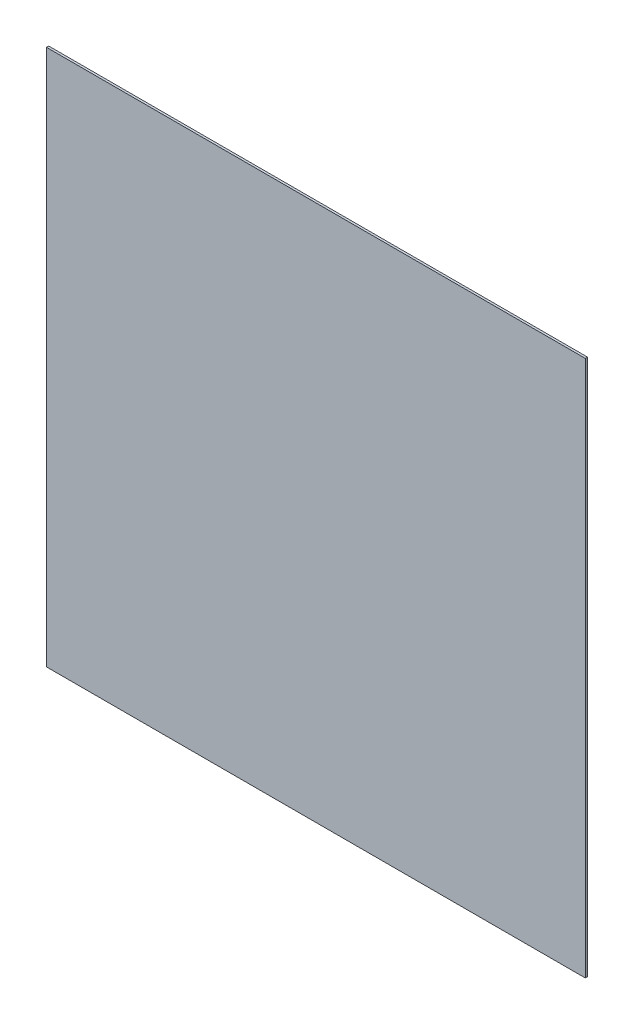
from build123d import *

# Parameters (mm, degrees)
SKETCH1_W      = 614.68
SKETCH1_H      = 612.14
EXTRUDE1_DEPTH = 2.54


with BuildPart() as part:
    # Sketch1 → Extrude1 (new body)
    with BuildSketch(Plane.XY):
        with Locations((-304.8, 303.53)):
            Rectangle(SKETCH1_W, SKETCH1_H)
    extrude(amount=EXTRUDE1_DEPTH)


solid = part.part
